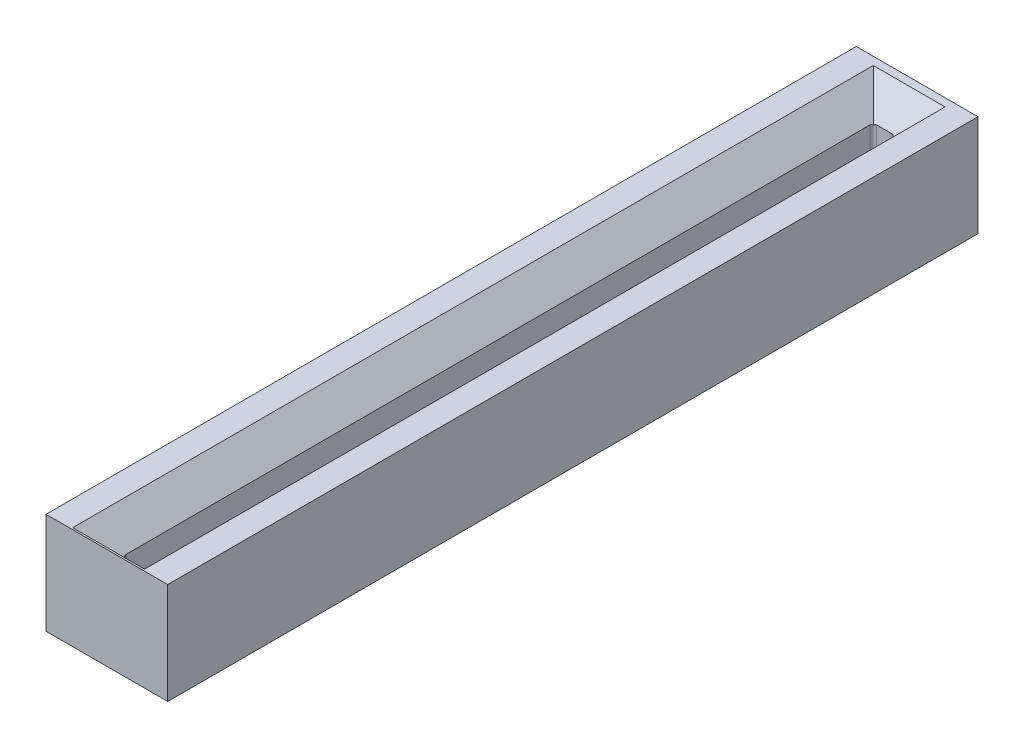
ISO-10303-21;
HEADER;
FILE_DESCRIPTION(('STEP AP214'),'2;1');
FILE_NAME('part.step','',(''),(''),'','','');
FILE_SCHEMA(('AUTOMOTIVE_DESIGN { 1 0 10303 214 1 1 1 1 }'));
ENDSEC;
DATA;
#1=APPLICATION_CONTEXT('core data for automotive mechanical design processes');
#2=APPLICATION_PROTOCOL_DEFINITION('international standard','automotive_design',2000,#1);
#3=PRODUCT_CONTEXT('',#1,'mechanical');
#4=PRODUCT('Part','Part','',(#3));
#5=PRODUCT_RELATED_PRODUCT_CATEGORY('part','',(#4));
#6=PRODUCT_DEFINITION_FORMATION('','',#4);
#7=PRODUCT_DEFINITION_CONTEXT('part definition',#1,'design');
#8=PRODUCT_DEFINITION('design','',#6,#7);
#9=PRODUCT_DEFINITION_SHAPE('','',#8);
#10=(LENGTH_UNIT() NAMED_UNIT(*) SI_UNIT(.MILLI.,.METRE.));
#11=(NAMED_UNIT(*) PLANE_ANGLE_UNIT() SI_UNIT($,.RADIAN.));
#12=(NAMED_UNIT(*) SI_UNIT($,.STERADIAN.) SOLID_ANGLE_UNIT());
#13=UNCERTAINTY_MEASURE_WITH_UNIT(LENGTH_MEASURE(1.E-05),#10,'distance_accuracy_value','');
#14=(GEOMETRIC_REPRESENTATION_CONTEXT(3) GLOBAL_UNCERTAINTY_ASSIGNED_CONTEXT((#13)) GLOBAL_UNIT_ASSIGNED_CONTEXT((#10,
#11,#12)) REPRESENTATION_CONTEXT('',''));
#15=CARTESIAN_POINT('',(0.,0.,0.));
#16=DIRECTION('',(0.,0.,1.));
#17=DIRECTION('',(1.,0.,0.));
#18=AXIS2_PLACEMENT_3D('',#15,#16,#17);
#19=CARTESIAN_POINT('',(0.,203.2,0.));
#20=DIRECTION('',(0.,1.,0.));
#21=DIRECTION('',(0.,0.,1.));
#22=AXIS2_PLACEMENT_3D('',#19,#20,#21);
#23=PLANE('',#22);
#24=DIRECTION('',(1.,0.,0.));
#25=VECTOR('',#24,1.);
#26=CARTESIAN_POINT('',(335.440572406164,203.2,-1638.));
#27=LINE('',#26,#25);
#28=CARTESIAN_POINT('',(-244.125000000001,203.2,-1638.));
#29=VERTEX_POINT('',#28);
#30=CARTESIAN_POINT('',(244.124999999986,203.2,-1638.));
#31=VERTEX_POINT('',#30);
#32=EDGE_CURVE('E204',#29,#31,#27,.T.);
#33=ORIENTED_EDGE('',*,*,#32,.F.);
#34=DIRECTION('',(0.,0.,1.));
#35=VECTOR('',#34,1.);
#36=CARTESIAN_POINT('',(-244.125,203.2,1706.025));
#37=LINE('',#36,#35);
#38=CARTESIAN_POINT('',(-244.125,203.2,1613.));
#39=VERTEX_POINT('',#38);
#40=EDGE_CURVE('E196',#29,#39,#37,.T.);
#41=ORIENTED_EDGE('',*,*,#40,.T.);
#42=DIRECTION('',(-1.,0.,0.));
#43=VECTOR('',#42,1.);
#44=CARTESIAN_POINT('',(312.148734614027,203.2,1613.));
#45=LINE('',#44,#43);
#46=CARTESIAN_POINT('',(244.124999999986,203.2,1613.));
#47=VERTEX_POINT('',#46);
#48=EDGE_CURVE('E65',#47,#39,#45,.T.);
#49=ORIENTED_EDGE('',*,*,#48,.F.);
#50=DIRECTION('',(0.,0.,-1.));
#51=VECTOR('',#50,1.);
#52=CARTESIAN_POINT('',(244.124999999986,203.2,1706.025));
#53=LINE('',#52,#51);
#54=EDGE_CURVE('E198',#47,#31,#53,.T.);
#55=ORIENTED_EDGE('',*,*,#54,.T.);
#56=EDGE_LOOP('',(#33,#41,#49,#55));
#57=FACE_BOUND('',#56,.T.);
#58=DIRECTION('',(1.,0.,0.));
#59=VECTOR('',#58,1.);
#60=CARTESIAN_POINT('',(0.,203.2,-1606.));
#61=LINE('',#60,#59);
#62=CARTESIAN_POINT('',(-144.1,203.2,-1606.));
#63=VERTEX_POINT('',#62);
#64=CARTESIAN_POINT('',(144.1,203.2,-1606.));
#65=VERTEX_POINT('',#64);
#66=EDGE_CURVE('E234',#63,#65,#61,.T.);
#67=ORIENTED_EDGE('',*,*,#66,.T.);
#68=DIRECTION('',(0.,0.,1.));
#69=VECTOR('',#68,1.);
#70=CARTESIAN_POINT('',(144.1,203.2,0.));
#71=LINE('',#70,#69);
#72=CARTESIAN_POINT('',(144.1,203.2,1606.));
#73=VERTEX_POINT('',#72);
#74=EDGE_CURVE('E240',#65,#73,#71,.T.);
#75=ORIENTED_EDGE('',*,*,#74,.T.);
#76=DIRECTION('',(-1.,0.,0.));
#77=VECTOR('',#76,1.);
#78=CARTESIAN_POINT('',(0.,203.2,1606.));
#79=LINE('',#78,#77);
#80=CARTESIAN_POINT('',(-144.1,203.2,1606.));
#81=VERTEX_POINT('',#80);
#82=EDGE_CURVE('E226',#73,#81,#79,.T.);
#83=ORIENTED_EDGE('',*,*,#82,.T.);
#84=DIRECTION('',(0.,0.,-1.));
#85=VECTOR('',#84,1.);
#86=CARTESIAN_POINT('',(-144.1,203.2,0.));
#87=LINE('',#86,#85);
#88=EDGE_CURVE('E233',#81,#63,#87,.T.);
#89=ORIENTED_EDGE('',*,*,#88,.T.);
#90=EDGE_LOOP('',(#67,#75,#83,#89));
#91=FACE_BOUND('',#90,.T.);
#92=ADVANCED_FACE('F50',(#57,#91),#23,.T.);
#93=CARTESIAN_POINT('',(0.,-203.2,0.));
#94=DIRECTION('',(0.,1.,0.));
#95=DIRECTION('',(0.,0.,1.));
#96=AXIS2_PLACEMENT_3D('',#93,#94,#95);
#97=PLANE('',#96);
#98=DIRECTION('',(0.,0.,-1.));
#99=VECTOR('',#98,1.);
#100=CARTESIAN_POINT('',(144.099999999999,-203.2,-1506.));
#101=LINE('',#100,#99);
#102=CARTESIAN_POINT('',(144.099999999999,-203.2,1606.));
#103=VERTEX_POINT('',#102);
#104=CARTESIAN_POINT('',(144.099999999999,-203.2,-1606.));
#105=VERTEX_POINT('',#104);
#106=EDGE_CURVE('E272',#103,#105,#101,.T.);
#107=ORIENTED_EDGE('',*,*,#106,.T.);
#108=DIRECTION('',(-1.,0.,0.));
#109=VECTOR('',#108,1.);
#110=CARTESIAN_POINT('',(-44.1000000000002,-203.2,-1606.));
#111=LINE('',#110,#109);
#112=CARTESIAN_POINT('',(-144.099999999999,-203.2,-1606.));
#113=VERTEX_POINT('',#112);
#114=EDGE_CURVE('E274',#105,#113,#111,.T.);
#115=ORIENTED_EDGE('',*,*,#114,.T.);
#116=DIRECTION('',(0.,0.,1.));
#117=VECTOR('',#116,1.);
#118=CARTESIAN_POINT('',(-144.099999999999,-203.2,1506.));
#119=LINE('',#118,#117);
#120=CARTESIAN_POINT('',(-144.099999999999,-203.2,1606.));
#121=VERTEX_POINT('',#120);
#122=EDGE_CURVE('E270',#113,#121,#119,.T.);
#123=ORIENTED_EDGE('',*,*,#122,.T.);
#124=DIRECTION('',(1.,0.,0.));
#125=VECTOR('',#124,1.);
#126=CARTESIAN_POINT('',(44.1000000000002,-203.2,1606.));
#127=LINE('',#126,#125);
#128=EDGE_CURVE('E261',#121,#103,#127,.T.);
#129=ORIENTED_EDGE('',*,*,#128,.T.);
#130=EDGE_LOOP('',(#107,#115,#123,#129));
#131=FACE_BOUND('',#130,.T.);
#132=DIRECTION('',(0.,0.,1.));
#133=VECTOR('',#132,1.);
#134=CARTESIAN_POINT('',(-244.125,-203.2,1706.025));
#135=LINE('',#134,#133);
#136=CARTESIAN_POINT('',(-244.125000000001,-203.2,-1638.));
#137=VERTEX_POINT('',#136);
#138=CARTESIAN_POINT('',(-244.125,-203.2,1613.));
#139=VERTEX_POINT('',#138);
#140=EDGE_CURVE('E210',#137,#139,#135,.T.);
#141=ORIENTED_EDGE('',*,*,#140,.F.);
#142=DIRECTION('',(1.,0.,0.));
#143=VECTOR('',#142,1.);
#144=CARTESIAN_POINT('',(335.440572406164,-203.2,-1638.));
#145=LINE('',#144,#143);
#146=CARTESIAN_POINT('',(244.124999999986,-203.2,-1638.));
#147=VERTEX_POINT('',#146);
#148=EDGE_CURVE('E72',#137,#147,#145,.T.);
#149=ORIENTED_EDGE('',*,*,#148,.T.);
#150=DIRECTION('',(0.,0.,-1.));
#151=VECTOR('',#150,1.);
#152=CARTESIAN_POINT('',(244.124999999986,-203.2,1706.025));
#153=LINE('',#152,#151);
#154=CARTESIAN_POINT('',(244.124999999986,-203.2,1613.));
#155=VERTEX_POINT('',#154);
#156=EDGE_CURVE('E213',#155,#147,#153,.T.);
#157=ORIENTED_EDGE('',*,*,#156,.F.);
#158=DIRECTION('',(-1.,0.,0.));
#159=VECTOR('',#158,1.);
#160=CARTESIAN_POINT('',(312.148734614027,-203.2,1613.));
#161=LINE('',#160,#159);
#162=EDGE_CURVE('E184',#155,#139,#161,.T.);
#163=ORIENTED_EDGE('',*,*,#162,.T.);
#164=EDGE_LOOP('',(#141,#149,#157,#163));
#165=FACE_BOUND('',#164,.T.);
#166=ADVANCED_FACE('F392',(#131,#165),#97,.F.);
#167=CARTESIAN_POINT('',(244.124999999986,203.2,1706.025));
#168=DIRECTION('',(-1.,0.,0.));
#169=DIRECTION('',(0.,0.,1.));
#170=AXIS2_PLACEMENT_3D('',#167,#168,#169);
#171=PLANE('',#170);
#172=ORIENTED_EDGE('',*,*,#156,.T.);
#173=DIRECTION('',(0.,1.,0.));
#174=VECTOR('',#173,1.);
#175=CARTESIAN_POINT('',(244.124999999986,203.2,-1638.));
#176=LINE('',#175,#174);
#177=EDGE_CURVE('E194',#147,#31,#176,.T.);
#178=ORIENTED_EDGE('',*,*,#177,.T.);
#179=ORIENTED_EDGE('',*,*,#54,.F.);
#180=DIRECTION('',(0.,-1.,0.));
#181=VECTOR('',#180,1.);
#182=CARTESIAN_POINT('',(244.124999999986,203.2,1613.));
#183=LINE('',#182,#181);
#184=EDGE_CURVE('E185',#47,#155,#183,.T.);
#185=ORIENTED_EDGE('',*,*,#184,.T.);
#186=EDGE_LOOP('',(#172,#178,#179,#185));
#187=FACE_BOUND('',#186,.T.);
#188=ADVANCED_FACE('F203',(#187),#171,.F.);
#189=CARTESIAN_POINT('',(-244.125,203.2,1706.025));
#190=DIRECTION('',(1.,0.,0.));
#191=DIRECTION('',(0.,0.,-1.));
#192=AXIS2_PLACEMENT_3D('',#189,#190,#191);
#193=PLANE('',#192);
#194=ORIENTED_EDGE('',*,*,#40,.F.);
#195=DIRECTION('',(0.,-1.,0.));
#196=VECTOR('',#195,1.);
#197=CARTESIAN_POINT('',(-244.125000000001,203.2,-1638.));
#198=LINE('',#197,#196);
#199=EDGE_CURVE('E11',#29,#137,#198,.T.);
#200=ORIENTED_EDGE('',*,*,#199,.T.);
#201=ORIENTED_EDGE('',*,*,#140,.T.);
#202=DIRECTION('',(0.,1.,0.));
#203=VECTOR('',#202,1.);
#204=CARTESIAN_POINT('',(-244.125,203.2,1613.));
#205=LINE('',#204,#203);
#206=EDGE_CURVE('E57',#139,#39,#205,.T.);
#207=ORIENTED_EDGE('',*,*,#206,.T.);
#208=EDGE_LOOP('',(#194,#200,#201,#207));
#209=FACE_BOUND('',#208,.T.);
#210=ADVANCED_FACE('F390',(#209),#193,.F.);
#211=CARTESIAN_POINT('',(-44.1000000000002,203.2,-1506.));
#212=DIRECTION('',(1.,0.,0.));
#213=DIRECTION('',(0.,0.,-1.));
#214=AXIS2_PLACEMENT_3D('',#211,#212,#213);
#215=PLANE('',#214);
#216=DIRECTION('',(0.,0.,1.));
#217=VECTOR('',#216,1.);
#218=CARTESIAN_POINT('',(-44.1000000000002,103.2,-1506.));
#219=LINE('',#218,#217);
#220=CARTESIAN_POINT('',(-44.1000000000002,103.2,-1493.));
#221=VERTEX_POINT('',#220);
#222=CARTESIAN_POINT('',(-44.0999999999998,103.2,1493.));
#223=VERTEX_POINT('',#222);
#224=EDGE_CURVE('E254',#221,#223,#219,.T.);
#225=ORIENTED_EDGE('',*,*,#224,.T.);
#226=DIRECTION('',(0.,-1.,0.));
#227=VECTOR('',#226,1.);
#228=CARTESIAN_POINT('',(-44.0999999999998,-103.2,1493.));
#229=LINE('',#228,#227);
#230=CARTESIAN_POINT('',(-44.0999999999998,-103.2,1493.));
#231=VERTEX_POINT('',#230);
#232=EDGE_CURVE('E318',#223,#231,#229,.T.);
#233=ORIENTED_EDGE('',*,*,#232,.T.);
#234=DIRECTION('',(0.,0.,-1.));
#235=VECTOR('',#234,1.);
#236=CARTESIAN_POINT('',(-44.1000000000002,-103.2,-1506.));
#237=LINE('',#236,#235);
#238=CARTESIAN_POINT('',(-44.1000000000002,-103.2,-1493.));
#239=VERTEX_POINT('',#238);
#240=EDGE_CURVE('E248',#231,#239,#237,.T.);
#241=ORIENTED_EDGE('',*,*,#240,.T.);
#242=DIRECTION('',(0.,-1.,0.));
#243=VECTOR('',#242,1.);
#244=CARTESIAN_POINT('',(-44.1000000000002,103.2,-1493.));
#245=LINE('',#244,#243);
#246=EDGE_CURVE('E320',#239,#221,#245,.F.);
#247=ORIENTED_EDGE('',*,*,#246,.T.);
#248=EDGE_LOOP('',(#225,#233,#241,#247));
#249=FACE_BOUND('',#248,.T.);
#250=ADVANCED_FACE('F411',(#249),#215,.T.);
#251=CARTESIAN_POINT('',(-44.0999999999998,203.2,1506.));
#252=DIRECTION('',(0.,0.,-1.));
#253=DIRECTION('',(-1.,0.,0.));
#254=AXIS2_PLACEMENT_3D('',#251,#252,#253);
#255=PLANE('',#254);
#256=DIRECTION('',(1.,0.,0.));
#257=VECTOR('',#256,1.);
#258=CARTESIAN_POINT('',(-44.0999999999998,103.2,1506.));
#259=LINE('',#258,#257);
#260=CARTESIAN_POINT('',(-31.0999999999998,103.2,1506.));
#261=VERTEX_POINT('',#260);
#262=CARTESIAN_POINT('',(31.1000000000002,103.2,1506.));
#263=VERTEX_POINT('',#262);
#264=EDGE_CURVE('E262',#261,#263,#259,.T.);
#265=ORIENTED_EDGE('',*,*,#264,.T.);
#266=DIRECTION('',(0.,-1.,0.));
#267=VECTOR('',#266,1.);
#268=CARTESIAN_POINT('',(31.1000000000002,-103.2,1506.));
#269=LINE('',#268,#267);
#270=CARTESIAN_POINT('',(31.1000000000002,-103.2,1506.));
#271=VERTEX_POINT('',#270);
#272=EDGE_CURVE('E306',#263,#271,#269,.T.);
#273=ORIENTED_EDGE('',*,*,#272,.T.);
#274=DIRECTION('',(-1.,0.,0.));
#275=VECTOR('',#274,1.);
#276=CARTESIAN_POINT('',(-44.0999999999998,-103.2,1506.));
#277=LINE('',#276,#275);
#278=CARTESIAN_POINT('',(-31.0999999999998,-103.2,1506.));
#279=VERTEX_POINT('',#278);
#280=EDGE_CURVE('E256',#271,#279,#277,.T.);
#281=ORIENTED_EDGE('',*,*,#280,.T.);
#282=DIRECTION('',(0.,-1.,0.));
#283=VECTOR('',#282,1.);
#284=CARTESIAN_POINT('',(-31.0999999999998,103.2,1506.));
#285=LINE('',#284,#283);
#286=EDGE_CURVE('E280',#279,#261,#285,.F.);
#287=ORIENTED_EDGE('',*,*,#286,.T.);
#288=EDGE_LOOP('',(#265,#273,#281,#287));
#289=FACE_BOUND('',#288,.T.);
#290=ADVANCED_FACE('F529',(#289),#255,.T.);
#291=CARTESIAN_POINT('',(44.1000000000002,203.2,1506.));
#292=DIRECTION('',(-1.,0.,0.));
#293=DIRECTION('',(0.,0.,1.));
#294=AXIS2_PLACEMENT_3D('',#291,#292,#293);
#295=PLANE('',#294);
#296=DIRECTION('',(0.,0.,1.));
#297=VECTOR('',#296,1.);
#298=CARTESIAN_POINT('',(44.1000000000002,-103.2,1506.));
#299=LINE('',#298,#297);
#300=CARTESIAN_POINT('',(44.0999999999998,-103.2,-1493.));
#301=VERTEX_POINT('',#300);
#302=CARTESIAN_POINT('',(44.1000000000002,-103.2,1493.));
#303=VERTEX_POINT('',#302);
#304=EDGE_CURVE('E214',#301,#303,#299,.T.);
#305=ORIENTED_EDGE('',*,*,#304,.T.);
#306=DIRECTION('',(0.,-1.,0.));
#307=VECTOR('',#306,1.);
#308=CARTESIAN_POINT('',(44.1000000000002,103.2,1493.));
#309=LINE('',#308,#307);
#310=CARTESIAN_POINT('',(44.1000000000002,103.2,1493.));
#311=VERTEX_POINT('',#310);
#312=EDGE_CURVE('E313',#303,#311,#309,.F.);
#313=ORIENTED_EDGE('',*,*,#312,.T.);
#314=DIRECTION('',(0.,0.,-1.));
#315=VECTOR('',#314,1.);
#316=CARTESIAN_POINT('',(44.1000000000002,103.2,1506.));
#317=LINE('',#316,#315);
#318=CARTESIAN_POINT('',(44.0999999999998,103.2,-1493.));
#319=VERTEX_POINT('',#318);
#320=EDGE_CURVE('E221',#311,#319,#317,.T.);
#321=ORIENTED_EDGE('',*,*,#320,.T.);
#322=DIRECTION('',(0.,-1.,0.));
#323=VECTOR('',#322,1.);
#324=CARTESIAN_POINT('',(44.0999999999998,-103.2,-1493.));
#325=LINE('',#324,#323);
#326=EDGE_CURVE('E309',#319,#301,#325,.T.);
#327=ORIENTED_EDGE('',*,*,#326,.T.);
#328=EDGE_LOOP('',(#305,#313,#321,#327));
#329=FACE_BOUND('',#328,.T.);
#330=ADVANCED_FACE('F536',(#329),#295,.T.);
#331=CARTESIAN_POINT('',(44.0999999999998,203.2,-1506.));
#332=DIRECTION('',(0.,0.,1.));
#333=DIRECTION('',(1.,0.,0.));
#334=AXIS2_PLACEMENT_3D('',#331,#332,#333);
#335=PLANE('',#334);
#336=DIRECTION('',(-1.,0.,0.));
#337=VECTOR('',#336,1.);
#338=CARTESIAN_POINT('',(44.0999999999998,103.2,-1506.));
#339=LINE('',#338,#337);
#340=CARTESIAN_POINT('',(31.0999999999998,103.2,-1506.));
#341=VERTEX_POINT('',#340);
#342=CARTESIAN_POINT('',(-31.1000000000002,103.2,-1506.));
#343=VERTEX_POINT('',#342);
#344=EDGE_CURVE('E244',#341,#343,#339,.T.);
#345=ORIENTED_EDGE('',*,*,#344,.T.);
#346=DIRECTION('',(0.,-1.,0.));
#347=VECTOR('',#346,1.);
#348=CARTESIAN_POINT('',(-31.1000000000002,-103.2,-1506.));
#349=LINE('',#348,#347);
#350=CARTESIAN_POINT('',(-31.1000000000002,-103.2,-1506.));
#351=VERTEX_POINT('',#350);
#352=EDGE_CURVE('E330',#343,#351,#349,.T.);
#353=ORIENTED_EDGE('',*,*,#352,.T.);
#354=DIRECTION('',(1.,0.,0.));
#355=VECTOR('',#354,1.);
#356=CARTESIAN_POINT('',(44.0999999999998,-103.2,-1506.));
#357=LINE('',#356,#355);
#358=CARTESIAN_POINT('',(31.0999999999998,-103.2,-1506.));
#359=VERTEX_POINT('',#358);
#360=EDGE_CURVE('E241',#351,#359,#357,.T.);
#361=ORIENTED_EDGE('',*,*,#360,.T.);
#362=DIRECTION('',(0.,-1.,0.));
#363=VECTOR('',#362,1.);
#364=CARTESIAN_POINT('',(31.0999999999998,103.2,-1506.));
#365=LINE('',#364,#363);
#366=EDGE_CURVE('E323',#359,#341,#365,.F.);
#367=ORIENTED_EDGE('',*,*,#366,.T.);
#368=EDGE_LOOP('',(#345,#353,#361,#367));
#369=FACE_BOUND('',#368,.T.);
#370=ADVANCED_FACE('F454',(#369),#335,.T.);
#371=CARTESIAN_POINT('',(-44.1000000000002,103.2,-1506.));
#372=DIRECTION('',(-0.707106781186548,-0.707106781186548,0.));
#373=DIRECTION('',(0.,0.,1.));
#374=AXIS2_PLACEMENT_3D('',#371,#372,#373);
#375=PLANE('',#374);
#376=DIRECTION('',(-0.577350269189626,0.577350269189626,-0.577350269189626));
#377=VECTOR('',#376,1.);
#378=CARTESIAN_POINT('',(-14.7000000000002,73.7999999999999,-1476.6));
#379=LINE('',#378,#377);
#380=CARTESIAN_POINT('',(-40.2923881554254,99.3923881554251,-1502.19238815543));
#381=VERTEX_POINT('',#380);
#382=EDGE_CURVE('E287',#63,#381,#379,.F.);
#383=ORIENTED_EDGE('',*,*,#382,.F.);
#384=ORIENTED_EDGE('',*,*,#88,.F.);
#385=DIRECTION('',(-0.577350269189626,0.577350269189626,0.577350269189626));
#386=VECTOR('',#385,1.);
#387=CARTESIAN_POINT('',(959.9,-900.8,502.));
#388=LINE('',#387,#386);
#389=CARTESIAN_POINT('',(-40.2923881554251,99.3923881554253,1502.19238815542));
#390=VERTEX_POINT('',#389);
#391=EDGE_CURVE('E219',#390,#81,#388,.T.);
#392=ORIENTED_EDGE('',*,*,#391,.F.);
#393=CARTESIAN_POINT('',(-31.0999999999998,90.1999999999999,1493.));
#394=DIRECTION('',(-0.707106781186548,-0.707106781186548,0.));
#395=DIRECTION('',(-0.707106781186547,0.707106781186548,0.));
#396=AXIS2_PLACEMENT_3D('',#393,#394,#395);
#397=ELLIPSE('',#396,18.3847763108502,13.);
#398=EDGE_CURVE('E358',#390,#223,#397,.T.);
#399=ORIENTED_EDGE('',*,*,#398,.T.);
#400=ORIENTED_EDGE('',*,*,#224,.F.);
#401=CARTESIAN_POINT('',(-31.1000000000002,90.1999999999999,-1493.));
#402=DIRECTION('',(-0.707106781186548,-0.707106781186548,0.));
#403=DIRECTION('',(-0.707106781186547,0.707106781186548,0.));
#404=AXIS2_PLACEMENT_3D('',#401,#402,#403);
#405=ELLIPSE('',#404,18.3847763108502,13.);
#406=EDGE_CURVE('E366',#221,#381,#405,.T.);
#407=ORIENTED_EDGE('',*,*,#406,.T.);
#408=EDGE_LOOP('',(#383,#384,#392,#399,#400,#407));
#409=FACE_BOUND('',#408,.T.);
#410=ADVANCED_FACE('F444',(#409),#375,.F.);
#411=CARTESIAN_POINT('',(-44.0999999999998,103.2,1506.));
#412=DIRECTION('',(0.,-0.707106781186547,0.707106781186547));
#413=DIRECTION('',(1.,0.,0.));
#414=AXIS2_PLACEMENT_3D('',#411,#412,#413);
#415=PLANE('',#414);
#416=ORIENTED_EDGE('',*,*,#391,.T.);
#417=ORIENTED_EDGE('',*,*,#82,.F.);
#418=DIRECTION('',(-0.577350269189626,-0.577350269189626,-0.577350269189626));
#419=VECTOR('',#418,1.);
#420=CARTESIAN_POINT('',(44.1000000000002,103.2,1506.));
#421=LINE('',#420,#419);
#422=CARTESIAN_POINT('',(40.2923881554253,99.3923881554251,1502.19238815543));
#423=VERTEX_POINT('',#422);
#424=EDGE_CURVE('E285',#423,#73,#421,.F.);
#425=ORIENTED_EDGE('',*,*,#424,.F.);
#426=CARTESIAN_POINT('',(31.1000000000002,90.2,1493.));
#427=DIRECTION('',(0.,-0.707106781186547,0.707106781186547));
#428=DIRECTION('',(0.,0.707106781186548,0.707106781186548));
#429=AXIS2_PLACEMENT_3D('',#426,#427,#428);
#430=ELLIPSE('',#429,18.3847763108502,13.);
#431=EDGE_CURVE('E341',#423,#263,#430,.T.);
#432=ORIENTED_EDGE('',*,*,#431,.T.);
#433=ORIENTED_EDGE('',*,*,#264,.F.);
#434=CARTESIAN_POINT('',(-31.0999999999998,90.2,1493.));
#435=DIRECTION('',(0.,-0.707106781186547,0.707106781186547));
#436=DIRECTION('',(0.,0.707106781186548,0.707106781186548));
#437=AXIS2_PLACEMENT_3D('',#434,#435,#436);
#438=ELLIPSE('',#437,18.3847763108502,13.);
#439=EDGE_CURVE('E354',#261,#390,#438,.T.);
#440=ORIENTED_EDGE('',*,*,#439,.T.);
#441=EDGE_LOOP('',(#416,#417,#425,#432,#433,#440));
#442=FACE_BOUND('',#441,.T.);
#443=ADVANCED_FACE('F438',(#442),#415,.F.);
#444=CARTESIAN_POINT('',(44.0999999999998,103.2,-1506.));
#445=DIRECTION('',(0.,-0.707106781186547,-0.707106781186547));
#446=DIRECTION('',(-1.,0.,0.));
#447=AXIS2_PLACEMENT_3D('',#444,#445,#446);
#448=PLANE('',#447);
#449=ORIENTED_EDGE('',*,*,#382,.T.);
#450=CARTESIAN_POINT('',(-31.1000000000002,90.2,-1493.));
#451=DIRECTION('',(0.,-0.707106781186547,-0.707106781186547));
#452=DIRECTION('',(0.,0.707106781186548,-0.707106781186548));
#453=AXIS2_PLACEMENT_3D('',#450,#451,#452);
#454=ELLIPSE('',#453,18.3847763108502,13.);
#455=EDGE_CURVE('E369',#381,#343,#454,.T.);
#456=ORIENTED_EDGE('',*,*,#455,.T.);
#457=ORIENTED_EDGE('',*,*,#344,.F.);
#458=CARTESIAN_POINT('',(31.0999999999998,90.2,-1493.));
#459=DIRECTION('',(0.,-0.707106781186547,-0.707106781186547));
#460=DIRECTION('',(0.,0.707106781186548,-0.707106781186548));
#461=AXIS2_PLACEMENT_3D('',#458,#459,#460);
#462=ELLIPSE('',#461,18.3847763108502,13.);
#463=CARTESIAN_POINT('',(40.2923881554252,99.3923881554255,-1502.19238815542));
#464=VERTEX_POINT('',#463);
#465=EDGE_CURVE('E379',#341,#464,#462,.T.);
#466=ORIENTED_EDGE('',*,*,#465,.T.);
#467=DIRECTION('',(0.577350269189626,0.577350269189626,-0.577350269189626));
#468=VECTOR('',#467,1.);
#469=CARTESIAN_POINT('',(-959.9,-900.8,-502.));
#470=LINE('',#469,#468);
#471=EDGE_CURVE('E278',#65,#464,#470,.F.);
#472=ORIENTED_EDGE('',*,*,#471,.F.);
#473=ORIENTED_EDGE('',*,*,#66,.F.);
#474=EDGE_LOOP('',(#449,#456,#457,#466,#472,#473));
#475=FACE_BOUND('',#474,.T.);
#476=ADVANCED_FACE('F431',(#475),#448,.F.);
#477=CARTESIAN_POINT('',(44.1000000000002,103.2,1506.));
#478=DIRECTION('',(0.707106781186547,-0.707106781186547,0.));
#479=DIRECTION('',(0.,0.,-1.));
#480=AXIS2_PLACEMENT_3D('',#477,#478,#479);
#481=PLANE('',#480);
#482=ORIENTED_EDGE('',*,*,#424,.T.);
#483=ORIENTED_EDGE('',*,*,#74,.F.);
#484=ORIENTED_EDGE('',*,*,#471,.T.);
#485=CARTESIAN_POINT('',(31.0999999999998,90.1999999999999,-1493.));
#486=DIRECTION('',(0.707106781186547,-0.707106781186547,0.));
#487=DIRECTION('',(0.707106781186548,0.707106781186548,0.));
#488=AXIS2_PLACEMENT_3D('',#485,#486,#487);
#489=ELLIPSE('',#488,18.3847763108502,13.);
#490=EDGE_CURVE('E381',#464,#319,#489,.T.);
#491=ORIENTED_EDGE('',*,*,#490,.T.);
#492=ORIENTED_EDGE('',*,*,#320,.F.);
#493=CARTESIAN_POINT('',(31.1000000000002,90.1999999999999,1493.));
#494=DIRECTION('',(0.707106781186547,-0.707106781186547,0.));
#495=DIRECTION('',(0.707106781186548,0.707106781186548,0.));
#496=AXIS2_PLACEMENT_3D('',#493,#494,#495);
#497=ELLIPSE('',#496,18.3847763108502,13.);
#498=EDGE_CURVE('E336',#311,#423,#497,.T.);
#499=ORIENTED_EDGE('',*,*,#498,.T.);
#500=EDGE_LOOP('',(#482,#483,#484,#491,#492,#499));
#501=FACE_BOUND('',#500,.T.);
#502=ADVANCED_FACE('F421',(#501),#481,.F.);
#503=CARTESIAN_POINT('',(0.,-203.2,1606.));
#504=DIRECTION('',(0.,-0.707106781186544,-0.707106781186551));
#505=DIRECTION('',(-1.,0.,0.));
#506=AXIS2_PLACEMENT_3D('',#503,#504,#505);
#507=PLANE('',#506);
#508=DIRECTION('',(0.577350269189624,0.577350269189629,-0.577350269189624));
#509=VECTOR('',#508,1.);
#510=CARTESIAN_POINT('',(391.233333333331,332.133333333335,1070.66666666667));
#511=LINE('',#510,#509);
#512=CARTESIAN_POINT('',(-40.2923881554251,-99.392388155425,1502.19238815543));
#513=VERTEX_POINT('',#512);
#514=EDGE_CURVE('E296',#513,#121,#511,.F.);
#515=ORIENTED_EDGE('',*,*,#514,.F.);
#516=CARTESIAN_POINT('',(-31.0999999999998,-90.1999999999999,1493.));
#517=DIRECTION('',(0.,-0.707106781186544,-0.707106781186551));
#518=DIRECTION('',(0.,0.707106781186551,-0.707106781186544));
#519=AXIS2_PLACEMENT_3D('',#516,#517,#518);
#520=ELLIPSE('',#519,18.3847763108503,13.);
#521=EDGE_CURVE('E349',#513,#279,#520,.F.);
#522=ORIENTED_EDGE('',*,*,#521,.T.);
#523=ORIENTED_EDGE('',*,*,#280,.F.);
#524=CARTESIAN_POINT('',(31.1000000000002,-90.1999999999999,1493.));
#525=DIRECTION('',(0.,-0.707106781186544,-0.707106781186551));
#526=DIRECTION('',(0.,0.707106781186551,-0.707106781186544));
#527=AXIS2_PLACEMENT_3D('',#524,#525,#526);
#528=ELLIPSE('',#527,18.3847763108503,13.);
#529=CARTESIAN_POINT('',(40.2923881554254,-99.3923881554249,1502.19238815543));
#530=VERTEX_POINT('',#529);
#531=EDGE_CURVE('E332',#271,#530,#528,.F.);
#532=ORIENTED_EDGE('',*,*,#531,.T.);
#533=DIRECTION('',(0.577350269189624,-0.577350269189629,0.577350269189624));
#534=VECTOR('',#533,1.);
#535=CARTESIAN_POINT('',(-391.233333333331,332.133333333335,1070.66666666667));
#536=LINE('',#535,#534);
#537=EDGE_CURVE('E283',#103,#530,#536,.F.);
#538=ORIENTED_EDGE('',*,*,#537,.F.);
#539=ORIENTED_EDGE('',*,*,#128,.F.);
#540=EDGE_LOOP('',(#515,#522,#523,#532,#538,#539));
#541=FACE_BOUND('',#540,.T.);
#542=ADVANCED_FACE('F427',(#541),#507,.T.);
#543=CARTESIAN_POINT('',(144.099999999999,-203.2,0.));
#544=DIRECTION('',(-0.707106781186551,-0.707106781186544,0.));
#545=DIRECTION('',(0.,0.,1.));
#546=AXIS2_PLACEMENT_3D('',#543,#544,#545);
#547=PLANE('',#546);
#548=ORIENTED_EDGE('',*,*,#537,.T.);
#549=CARTESIAN_POINT('',(31.1000000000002,-90.1999999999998,1493.));
#550=DIRECTION('',(-0.707106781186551,-0.707106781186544,0.));
#551=DIRECTION('',(-0.707106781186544,0.707106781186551,0.));
#552=AXIS2_PLACEMENT_3D('',#549,#550,#551);
#553=ELLIPSE('',#552,18.3847763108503,13.);
#554=EDGE_CURVE('E333',#530,#303,#553,.F.);
#555=ORIENTED_EDGE('',*,*,#554,.T.);
#556=ORIENTED_EDGE('',*,*,#304,.F.);
#557=CARTESIAN_POINT('',(31.0999999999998,-90.1999999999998,-1493.));
#558=DIRECTION('',(-0.707106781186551,-0.707106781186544,0.));
#559=DIRECTION('',(-0.707106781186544,0.707106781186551,0.));
#560=AXIS2_PLACEMENT_3D('',#557,#558,#559);
#561=ELLIPSE('',#560,18.3847763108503,13.);
#562=CARTESIAN_POINT('',(40.292388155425,-99.392388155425,-1502.19238815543));
#563=VERTEX_POINT('',#562);
#564=EDGE_CURVE('E373',#301,#563,#561,.F.);
#565=ORIENTED_EDGE('',*,*,#564,.T.);
#566=DIRECTION('',(0.577350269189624,-0.577350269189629,-0.577350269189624));
#567=VECTOR('',#566,1.);
#568=CARTESIAN_POINT('',(96.0666666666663,-155.166666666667,-1557.96666666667));
#569=LINE('',#568,#567);
#570=EDGE_CURVE('E294',#105,#563,#569,.F.);
#571=ORIENTED_EDGE('',*,*,#570,.F.);
#572=ORIENTED_EDGE('',*,*,#106,.F.);
#573=EDGE_LOOP('',(#548,#555,#556,#565,#571,#572));
#574=FACE_BOUND('',#573,.T.);
#575=ADVANCED_FACE('F466',(#574),#547,.T.);
#576=CARTESIAN_POINT('',(-144.099999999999,-203.2,0.));
#577=DIRECTION('',(0.707106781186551,-0.707106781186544,0.));
#578=DIRECTION('',(0.,0.,-1.));
#579=AXIS2_PLACEMENT_3D('',#576,#577,#578);
#580=PLANE('',#579);
#581=ORIENTED_EDGE('',*,*,#514,.T.);
#582=ORIENTED_EDGE('',*,*,#122,.F.);
#583=DIRECTION('',(0.577350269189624,0.577350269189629,0.577350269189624));
#584=VECTOR('',#583,1.);
#585=CARTESIAN_POINT('',(-96.0666666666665,-155.166666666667,-1557.96666666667));
#586=LINE('',#585,#584);
#587=CARTESIAN_POINT('',(-40.2923881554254,-99.392388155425,-1502.19238815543));
#588=VERTEX_POINT('',#587);
#589=EDGE_CURVE('E292',#588,#113,#586,.F.);
#590=ORIENTED_EDGE('',*,*,#589,.F.);
#591=CARTESIAN_POINT('',(-31.1000000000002,-90.1999999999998,-1493.));
#592=DIRECTION('',(0.707106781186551,-0.707106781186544,0.));
#593=DIRECTION('',(0.707106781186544,0.707106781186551,0.));
#594=AXIS2_PLACEMENT_3D('',#591,#592,#593);
#595=ELLIPSE('',#594,18.3847763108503,13.);
#596=EDGE_CURVE('E361',#588,#239,#595,.F.);
#597=ORIENTED_EDGE('',*,*,#596,.T.);
#598=ORIENTED_EDGE('',*,*,#240,.F.);
#599=CARTESIAN_POINT('',(-31.0999999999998,-90.1999999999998,1493.));
#600=DIRECTION('',(0.707106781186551,-0.707106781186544,0.));
#601=DIRECTION('',(0.707106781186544,0.707106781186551,0.));
#602=AXIS2_PLACEMENT_3D('',#599,#600,#601);
#603=ELLIPSE('',#602,18.3847763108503,13.);
#604=EDGE_CURVE('E342',#231,#513,#603,.F.);
#605=ORIENTED_EDGE('',*,*,#604,.T.);
#606=EDGE_LOOP('',(#581,#582,#590,#597,#598,#605));
#607=FACE_BOUND('',#606,.T.);
#608=ADVANCED_FACE('F462',(#607),#580,.T.);
#609=CARTESIAN_POINT('',(0.,-203.2,-1606.));
#610=DIRECTION('',(0.,-0.707106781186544,0.707106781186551));
#611=DIRECTION('',(1.,0.,0.));
#612=AXIS2_PLACEMENT_3D('',#609,#610,#611);
#613=PLANE('',#612);
#614=ORIENTED_EDGE('',*,*,#570,.T.);
#615=CARTESIAN_POINT('',(31.0999999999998,-90.1999999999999,-1493.));
#616=DIRECTION('',(0.,-0.707106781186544,0.707106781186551));
#617=DIRECTION('',(0.,0.707106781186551,0.707106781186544));
#618=AXIS2_PLACEMENT_3D('',#615,#616,#617);
#619=ELLIPSE('',#618,18.3847763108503,13.);
#620=EDGE_CURVE('E380',#563,#359,#619,.F.);
#621=ORIENTED_EDGE('',*,*,#620,.T.);
#622=ORIENTED_EDGE('',*,*,#360,.F.);
#623=CARTESIAN_POINT('',(-31.1000000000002,-90.1999999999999,-1493.));
#624=DIRECTION('',(0.,-0.707106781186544,0.707106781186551));
#625=DIRECTION('',(0.,0.707106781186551,0.707106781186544));
#626=AXIS2_PLACEMENT_3D('',#623,#624,#625);
#627=ELLIPSE('',#626,18.3847763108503,13.);
#628=EDGE_CURVE('E360',#351,#588,#627,.F.);
#629=ORIENTED_EDGE('',*,*,#628,.T.);
#630=ORIENTED_EDGE('',*,*,#589,.T.);
#631=ORIENTED_EDGE('',*,*,#114,.F.);
#632=EDGE_LOOP('',(#614,#621,#622,#629,#630,#631));
#633=FACE_BOUND('',#632,.T.);
#634=ADVANCED_FACE('F453',(#633),#613,.T.);
#635=CARTESIAN_POINT('',(31.1000000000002,203.2,1493.));
#636=DIRECTION('',(0.,1.,0.));
#637=DIRECTION('',(0.,0.,1.));
#638=AXIS2_PLACEMENT_3D('',#635,#636,#637);
#639=CYLINDRICAL_SURFACE('',#638,13.);
#640=ORIENTED_EDGE('',*,*,#498,.F.);
#641=ORIENTED_EDGE('',*,*,#312,.F.);
#642=ORIENTED_EDGE('',*,*,#554,.F.);
#643=ORIENTED_EDGE('',*,*,#531,.F.);
#644=ORIENTED_EDGE('',*,*,#272,.F.);
#645=ORIENTED_EDGE('',*,*,#431,.F.);
#646=EDGE_LOOP('',(#640,#641,#642,#643,#644,#645));
#647=FACE_BOUND('',#646,.T.);
#648=ADVANCED_FACE('F456',(#647),#639,.F.);
#649=CARTESIAN_POINT('',(-31.0999999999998,203.2,1493.));
#650=DIRECTION('',(0.,1.,0.));
#651=DIRECTION('',(0.,0.,1.));
#652=AXIS2_PLACEMENT_3D('',#649,#650,#651);
#653=CYLINDRICAL_SURFACE('',#652,13.);
#654=ORIENTED_EDGE('',*,*,#439,.F.);
#655=ORIENTED_EDGE('',*,*,#286,.F.);
#656=ORIENTED_EDGE('',*,*,#521,.F.);
#657=ORIENTED_EDGE('',*,*,#604,.F.);
#658=ORIENTED_EDGE('',*,*,#232,.F.);
#659=ORIENTED_EDGE('',*,*,#398,.F.);
#660=EDGE_LOOP('',(#654,#655,#656,#657,#658,#659));
#661=FACE_BOUND('',#660,.T.);
#662=ADVANCED_FACE('F484',(#661),#653,.F.);
#663=CARTESIAN_POINT('',(-31.1000000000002,203.2,-1493.));
#664=DIRECTION('',(0.,1.,0.));
#665=DIRECTION('',(0.,0.,1.));
#666=AXIS2_PLACEMENT_3D('',#663,#664,#665);
#667=CYLINDRICAL_SURFACE('',#666,13.);
#668=ORIENTED_EDGE('',*,*,#406,.F.);
#669=ORIENTED_EDGE('',*,*,#246,.F.);
#670=ORIENTED_EDGE('',*,*,#596,.F.);
#671=ORIENTED_EDGE('',*,*,#628,.F.);
#672=ORIENTED_EDGE('',*,*,#352,.F.);
#673=ORIENTED_EDGE('',*,*,#455,.F.);
#674=EDGE_LOOP('',(#668,#669,#670,#671,#672,#673));
#675=FACE_BOUND('',#674,.T.);
#676=ADVANCED_FACE('F483',(#675),#667,.F.);
#677=CARTESIAN_POINT('',(31.0999999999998,203.2,-1493.));
#678=DIRECTION('',(0.,1.,0.));
#679=DIRECTION('',(0.,0.,1.));
#680=AXIS2_PLACEMENT_3D('',#677,#678,#679);
#681=CYLINDRICAL_SURFACE('',#680,13.);
#682=ORIENTED_EDGE('',*,*,#465,.F.);
#683=ORIENTED_EDGE('',*,*,#366,.F.);
#684=ORIENTED_EDGE('',*,*,#620,.F.);
#685=ORIENTED_EDGE('',*,*,#564,.F.);
#686=ORIENTED_EDGE('',*,*,#326,.F.);
#687=ORIENTED_EDGE('',*,*,#490,.F.);
#688=EDGE_LOOP('',(#682,#683,#684,#685,#686,#687));
#689=FACE_BOUND('',#688,.T.);
#690=ADVANCED_FACE('F47',(#689),#681,.F.);
#691=CARTESIAN_POINT('',(312.148734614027,-203.2,1613.));
#692=DIRECTION('',(0.,0.,-1.));
#693=DIRECTION('',(-1.,0.,0.));
#694=AXIS2_PLACEMENT_3D('',#691,#692,#693);
#695=PLANE('',#694);
#696=ORIENTED_EDGE('',*,*,#48,.T.);
#697=ORIENTED_EDGE('',*,*,#206,.F.);
#698=ORIENTED_EDGE('',*,*,#162,.F.);
#699=ORIENTED_EDGE('',*,*,#184,.F.);
#700=EDGE_LOOP('',(#696,#697,#698,#699));
#701=FACE_BOUND('',#700,.T.);
#702=ADVANCED_FACE('F182',(#701),#695,.F.);
#703=CARTESIAN_POINT('',(335.440572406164,-203.2,-1638.));
#704=DIRECTION('',(0.,0.,1.));
#705=DIRECTION('',(1.,0.,0.));
#706=AXIS2_PLACEMENT_3D('',#703,#704,#705);
#707=PLANE('',#706);
#708=ORIENTED_EDGE('',*,*,#148,.F.);
#709=ORIENTED_EDGE('',*,*,#199,.F.);
#710=ORIENTED_EDGE('',*,*,#32,.T.);
#711=ORIENTED_EDGE('',*,*,#177,.F.);
#712=EDGE_LOOP('',(#708,#709,#710,#711));
#713=FACE_BOUND('',#712,.T.);
#714=ADVANCED_FACE('F400',(#713),#707,.F.);
#715=CLOSED_SHELL('',(#92,#166,#188,#210,#250,#290,#330,#370,#410,#443,#476,#502,#542,#575,#608,
#634,#648,#662,#676,#690,#702,#714));
#716=MANIFOLD_SOLID_BREP('B2',#715);
#717=ADVANCED_BREP_SHAPE_REPRESENTATION('',(#18,#716),#14);
#718=SHAPE_DEFINITION_REPRESENTATION(#9,#717);
ENDSEC;
END-ISO-10303-21;
